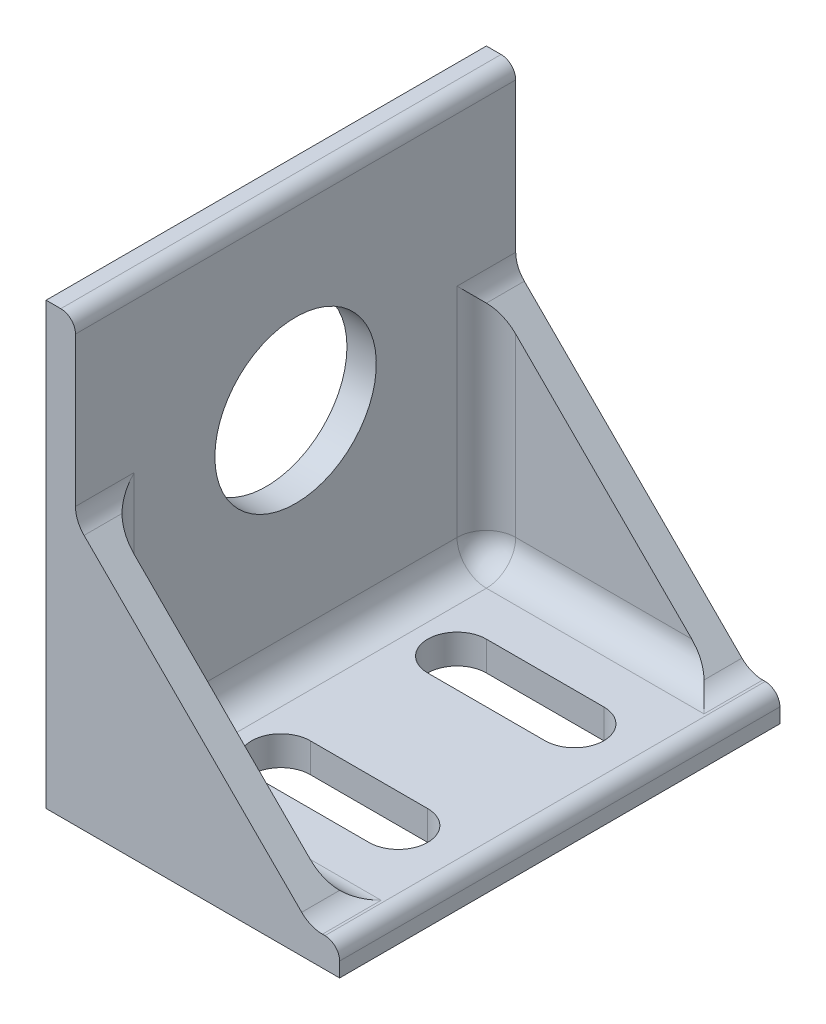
ISO-10303-21;
HEADER;
FILE_DESCRIPTION(('STEP AP214'),'2;1');
FILE_NAME('part.step','',(''),(''),'','','');
FILE_SCHEMA(('AUTOMOTIVE_DESIGN { 1 0 10303 214 1 1 1 1 }'));
ENDSEC;
DATA;
#1=APPLICATION_CONTEXT('core data for automotive mechanical design processes');
#2=APPLICATION_PROTOCOL_DEFINITION('international standard','automotive_design',2000,#1);
#3=PRODUCT_CONTEXT('',#1,'mechanical');
#4=PRODUCT('Part','Part','',(#3));
#5=PRODUCT_RELATED_PRODUCT_CATEGORY('part','',(#4));
#6=PRODUCT_DEFINITION_FORMATION('','',#4);
#7=PRODUCT_DEFINITION_CONTEXT('part definition',#1,'design');
#8=PRODUCT_DEFINITION('design','',#6,#7);
#9=PRODUCT_DEFINITION_SHAPE('','',#8);
#10=(LENGTH_UNIT() NAMED_UNIT(*) SI_UNIT(.MILLI.,.METRE.));
#11=(NAMED_UNIT(*) PLANE_ANGLE_UNIT() SI_UNIT($,.RADIAN.));
#12=(NAMED_UNIT(*) SI_UNIT($,.STERADIAN.) SOLID_ANGLE_UNIT());
#13=UNCERTAINTY_MEASURE_WITH_UNIT(LENGTH_MEASURE(1.E-05),#10,'distance_accuracy_value','');
#14=(GEOMETRIC_REPRESENTATION_CONTEXT(3) GLOBAL_UNCERTAINTY_ASSIGNED_CONTEXT((#13)) GLOBAL_UNIT_ASSIGNED_CONTEXT((#10,
#11,#12)) REPRESENTATION_CONTEXT('',''));
#15=CARTESIAN_POINT('',(0.,0.,0.));
#16=DIRECTION('',(0.,0.,1.));
#17=DIRECTION('',(1.,0.,0.));
#18=AXIS2_PLACEMENT_3D('',#15,#16,#17);
#19=CARTESIAN_POINT('',(2.,17.9999999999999,30.));
#20=DIRECTION('',(-0.707106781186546,-0.707106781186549,0.));
#21=DIRECTION('',(0.707106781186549,-0.707106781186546,0.));
#22=AXIS2_PLACEMENT_3D('',#19,#20,#21);
#23=PLANE('',#22);
#24=DIRECTION('',(-0.707106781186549,0.707106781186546,0.));
#25=VECTOR('',#24,1.);
#26=CARTESIAN_POINT('',(2.,17.9999999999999,30.));
#27=LINE('',#26,#25);
#28=CARTESIAN_POINT('',(17.4142135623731,2.5857864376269,30.));
#29=VERTEX_POINT('',#28);
#30=CARTESIAN_POINT('',(2.58578643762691,17.414213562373,30.));
#31=VERTEX_POINT('',#30);
#32=EDGE_CURVE('E308',#29,#31,#27,.T.);
#33=ORIENTED_EDGE('',*,*,#32,.F.);
#34=DIRECTION('',(0.,0.,-1.));
#35=VECTOR('',#34,1.);
#36=CARTESIAN_POINT('',(17.4142135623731,2.5857864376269,28.));
#37=LINE('',#36,#35);
#38=CARTESIAN_POINT('',(17.4142135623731,2.5857864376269,27.4142135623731));
#39=VERTEX_POINT('',#38);
#40=EDGE_CURVE('E343',#29,#39,#37,.T.);
#41=ORIENTED_EDGE('',*,*,#40,.T.);
#42=CARTESIAN_POINT('',(16.,4.,26.));
#43=DIRECTION('',(-0.707106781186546,-0.707106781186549,0.));
#44=DIRECTION('',(-0.707106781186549,0.707106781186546,0.));
#45=AXIS2_PLACEMENT_3D('',#42,#43,#44);
#46=ELLIPSE('',#45,2.8284271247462,2.);
#47=CARTESIAN_POINT('',(16.,4.,28.));
#48=VERTEX_POINT('',#47);
#49=EDGE_CURVE('E406',#39,#48,#46,.T.);
#50=ORIENTED_EDGE('',*,*,#49,.T.);
#51=DIRECTION('',(0.707106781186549,-0.707106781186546,0.));
#52=VECTOR('',#51,1.);
#53=CARTESIAN_POINT('',(2.,17.9999999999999,28.));
#54=LINE('',#53,#52);
#55=CARTESIAN_POINT('',(4.,15.9999999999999,28.));
#56=VERTEX_POINT('',#55);
#57=EDGE_CURVE('E292',#56,#48,#54,.T.);
#58=ORIENTED_EDGE('',*,*,#57,.F.);
#59=CARTESIAN_POINT('',(4.,15.9999999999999,26.));
#60=DIRECTION('',(-0.707106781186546,-0.707106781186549,0.));
#61=DIRECTION('',(0.707106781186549,-0.707106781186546,0.));
#62=AXIS2_PLACEMENT_3D('',#59,#60,#61);
#63=ELLIPSE('',#62,2.82842712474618,2.);
#64=CARTESIAN_POINT('',(2.58578643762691,17.414213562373,27.4142135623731));
#65=VERTEX_POINT('',#64);
#66=EDGE_CURVE('E408',#56,#65,#63,.T.);
#67=ORIENTED_EDGE('',*,*,#66,.T.);
#68=DIRECTION('',(0.,0.,-1.));
#69=VECTOR('',#68,1.);
#70=CARTESIAN_POINT('',(2.58578643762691,17.414213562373,30.));
#71=LINE('',#70,#69);
#72=EDGE_CURVE('E341',#65,#31,#71,.F.);
#73=ORIENTED_EDGE('',*,*,#72,.T.);
#74=EDGE_LOOP('',(#33,#41,#50,#58,#67,#73));
#75=FACE_BOUND('',#74,.T.);
#76=ADVANCED_FACE('F33',(#75),#23,.F.);
#77=DIRECTION('',(-0.707106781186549,0.707106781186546,0.));
#78=VECTOR('',#77,1.);
#79=CARTESIAN_POINT('',(2.,17.9999999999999,2.));
#80=LINE('',#79,#78);
#81=CARTESIAN_POINT('',(16.,4.,2.));
#82=VERTEX_POINT('',#81);
#83=CARTESIAN_POINT('',(4.,15.9999999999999,2.));
#84=VERTEX_POINT('',#83);
#85=EDGE_CURVE('E289',#82,#84,#80,.T.);
#86=ORIENTED_EDGE('',*,*,#85,.F.);
#87=CARTESIAN_POINT('',(16.,4.,4.));
#88=DIRECTION('',(-0.707106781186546,-0.707106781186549,0.));
#89=DIRECTION('',(-0.707106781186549,0.707106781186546,0.));
#90=AXIS2_PLACEMENT_3D('',#87,#88,#89);
#91=ELLIPSE('',#90,2.8284271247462,2.);
#92=CARTESIAN_POINT('',(17.4142135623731,2.5857864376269,2.58578643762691));
#93=VERTEX_POINT('',#92);
#94=EDGE_CURVE('E392',#82,#93,#91,.T.);
#95=ORIENTED_EDGE('',*,*,#94,.T.);
#96=DIRECTION('',(0.,0.,-1.));
#97=VECTOR('',#96,1.);
#98=CARTESIAN_POINT('',(17.4142135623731,2.5857864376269,0.));
#99=LINE('',#98,#97);
#100=CARTESIAN_POINT('',(17.4142135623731,2.5857864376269,0.));
#101=VERTEX_POINT('',#100);
#102=EDGE_CURVE('E352',#93,#101,#99,.T.);
#103=ORIENTED_EDGE('',*,*,#102,.T.);
#104=DIRECTION('',(-0.707106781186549,0.707106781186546,0.));
#105=VECTOR('',#104,1.);
#106=CARTESIAN_POINT('',(2.,17.9999999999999,0.));
#107=LINE('',#106,#105);
#108=CARTESIAN_POINT('',(2.58578643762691,17.414213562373,0.));
#109=VERTEX_POINT('',#108);
#110=EDGE_CURVE('E326',#101,#109,#107,.T.);
#111=ORIENTED_EDGE('',*,*,#110,.T.);
#112=DIRECTION('',(0.,0.,-1.));
#113=VECTOR('',#112,1.);
#114=CARTESIAN_POINT('',(2.58578643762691,17.414213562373,2.));
#115=LINE('',#114,#113);
#116=CARTESIAN_POINT('',(2.58578643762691,17.414213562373,2.5857864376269));
#117=VERTEX_POINT('',#116);
#118=EDGE_CURVE('E350',#109,#117,#115,.F.);
#119=ORIENTED_EDGE('',*,*,#118,.T.);
#120=CARTESIAN_POINT('',(4.,15.9999999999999,4.));
#121=DIRECTION('',(-0.707106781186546,-0.707106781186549,0.));
#122=DIRECTION('',(-0.707106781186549,0.707106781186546,0.));
#123=AXIS2_PLACEMENT_3D('',#120,#121,#122);
#124=ELLIPSE('',#123,2.82842712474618,2.);
#125=EDGE_CURVE('E401',#117,#84,#124,.T.);
#126=ORIENTED_EDGE('',*,*,#125,.T.);
#127=EDGE_LOOP('',(#86,#95,#103,#111,#119,#126));
#128=FACE_BOUND('',#127,.T.);
#129=ADVANCED_FACE('F475',(#128),#23,.F.);
#130=CARTESIAN_POINT('',(0.,0.,30.));
#131=DIRECTION('',(1.,0.,0.));
#132=DIRECTION('',(0.,0.,-1.));
#133=AXIS2_PLACEMENT_3D('',#130,#131,#132);
#134=PLANE('',#133);
#135=CARTESIAN_POINT('',(0.,17.,15.));
#136=DIRECTION('',(-1.,0.,0.));
#137=DIRECTION('',(0.,0.,1.));
#138=AXIS2_PLACEMENT_3D('',#135,#136,#137);
#139=CIRCLE('',#138,5.5);
#140=CARTESIAN_POINT('',(0.,17.,20.5));
#141=VERTEX_POINT('',#140);
#142=EDGE_CURVE('E280',#141,#141,#139,.T.);
#143=ORIENTED_EDGE('',*,*,#142,.F.);
#144=EDGE_LOOP('',(#143));
#145=FACE_BOUND('',#144,.T.);
#146=DIRECTION('',(0.,-1.,0.));
#147=VECTOR('',#146,1.);
#148=CARTESIAN_POINT('',(0.,0.,0.));
#149=LINE('',#148,#147);
#150=CARTESIAN_POINT('',(0.,30.,0.));
#151=VERTEX_POINT('',#150);
#152=CARTESIAN_POINT('',(0.,0.,0.));
#153=VERTEX_POINT('',#152);
#154=EDGE_CURVE('E296',#151,#153,#149,.T.);
#155=ORIENTED_EDGE('',*,*,#154,.T.);
#156=DIRECTION('',(0.,0.,-1.));
#157=VECTOR('',#156,1.);
#158=CARTESIAN_POINT('',(0.,0.,30.));
#159=LINE('',#158,#157);
#160=CARTESIAN_POINT('',(0.,0.,30.));
#161=VERTEX_POINT('',#160);
#162=EDGE_CURVE('E338',#161,#153,#159,.T.);
#163=ORIENTED_EDGE('',*,*,#162,.F.);
#164=DIRECTION('',(0.,-1.,0.));
#165=VECTOR('',#164,1.);
#166=CARTESIAN_POINT('',(0.,0.,30.));
#167=LINE('',#166,#165);
#168=CARTESIAN_POINT('',(0.,30.,30.));
#169=VERTEX_POINT('',#168);
#170=EDGE_CURVE('E297',#169,#161,#167,.T.);
#171=ORIENTED_EDGE('',*,*,#170,.F.);
#172=DIRECTION('',(0.,0.,-1.));
#173=VECTOR('',#172,1.);
#174=CARTESIAN_POINT('',(0.,30.,30.));
#175=LINE('',#174,#173);
#176=EDGE_CURVE('E316',#169,#151,#175,.T.);
#177=ORIENTED_EDGE('',*,*,#176,.T.);
#178=EDGE_LOOP('',(#155,#163,#171,#177));
#179=FACE_BOUND('',#178,.T.);
#180=ADVANCED_FACE('F460',(#145,#179),#134,.F.);
#181=CARTESIAN_POINT('',(0.,0.,30.));
#182=DIRECTION('',(0.,1.,0.));
#183=DIRECTION('',(0.,0.,1.));
#184=AXIS2_PLACEMENT_3D('',#181,#182,#183);
#185=PLANE('',#184);
#186=DIRECTION('',(-1.,0.,0.));
#187=VECTOR('',#186,1.);
#188=CARTESIAN_POINT('',(7.,0.,7.));
#189=LINE('',#188,#187);
#190=CARTESIAN_POINT('',(15.,0.,7.));
#191=VERTEX_POINT('',#190);
#192=CARTESIAN_POINT('',(7.,0.,7.));
#193=VERTEX_POINT('',#192);
#194=EDGE_CURVE('E226',#191,#193,#189,.T.);
#195=ORIENTED_EDGE('',*,*,#194,.T.);
#196=CARTESIAN_POINT('',(7.,0.,9.));
#197=DIRECTION('',(0.,1.,0.));
#198=DIRECTION('',(0.,0.,-1.));
#199=AXIS2_PLACEMENT_3D('',#196,#197,#198);
#200=CIRCLE('',#199,2.);
#201=CARTESIAN_POINT('',(7.,0.,11.));
#202=VERTEX_POINT('',#201);
#203=EDGE_CURVE('E220',#193,#202,#200,.T.);
#204=ORIENTED_EDGE('',*,*,#203,.T.);
#205=DIRECTION('',(1.,0.,0.));
#206=VECTOR('',#205,1.);
#207=CARTESIAN_POINT('',(7.,0.,11.));
#208=LINE('',#207,#206);
#209=CARTESIAN_POINT('',(15.,0.,11.));
#210=VERTEX_POINT('',#209);
#211=EDGE_CURVE('E229',#202,#210,#208,.T.);
#212=ORIENTED_EDGE('',*,*,#211,.T.);
#213=CARTESIAN_POINT('',(15.,0.,9.));
#214=DIRECTION('',(0.,1.,0.));
#215=DIRECTION('',(0.,0.,1.));
#216=AXIS2_PLACEMENT_3D('',#213,#214,#215);
#217=CIRCLE('',#216,2.);
#218=EDGE_CURVE('E49',#210,#191,#217,.T.);
#219=ORIENTED_EDGE('',*,*,#218,.T.);
#220=EDGE_LOOP('',(#195,#204,#212,#219));
#221=FACE_BOUND('',#220,.T.);
#222=DIRECTION('',(1.,0.,0.));
#223=VECTOR('',#222,1.);
#224=CARTESIAN_POINT('',(7.,0.,23.));
#225=LINE('',#224,#223);
#226=CARTESIAN_POINT('',(7.,0.,23.));
#227=VERTEX_POINT('',#226);
#228=CARTESIAN_POINT('',(15.,0.,23.));
#229=VERTEX_POINT('',#228);
#230=EDGE_CURVE('E265',#227,#229,#225,.T.);
#231=ORIENTED_EDGE('',*,*,#230,.T.);
#232=CARTESIAN_POINT('',(15.,0.,21.));
#233=DIRECTION('',(0.,1.,0.));
#234=DIRECTION('',(0.,0.,1.));
#235=AXIS2_PLACEMENT_3D('',#232,#233,#234);
#236=CIRCLE('',#235,2.);
#237=CARTESIAN_POINT('',(15.,0.,19.));
#238=VERTEX_POINT('',#237);
#239=EDGE_CURVE('E255',#229,#238,#236,.T.);
#240=ORIENTED_EDGE('',*,*,#239,.T.);
#241=DIRECTION('',(-1.,0.,0.));
#242=VECTOR('',#241,1.);
#243=CARTESIAN_POINT('',(7.,0.,19.));
#244=LINE('',#243,#242);
#245=CARTESIAN_POINT('',(7.,0.,19.));
#246=VERTEX_POINT('',#245);
#247=EDGE_CURVE('E258',#238,#246,#244,.T.);
#248=ORIENTED_EDGE('',*,*,#247,.T.);
#249=CARTESIAN_POINT('',(7.,0.,21.));
#250=DIRECTION('',(0.,1.,0.));
#251=DIRECTION('',(0.,0.,-1.));
#252=AXIS2_PLACEMENT_3D('',#249,#250,#251);
#253=CIRCLE('',#252,2.);
#254=EDGE_CURVE('E262',#246,#227,#253,.T.);
#255=ORIENTED_EDGE('',*,*,#254,.T.);
#256=EDGE_LOOP('',(#231,#240,#248,#255));
#257=FACE_BOUND('',#256,.T.);
#258=DIRECTION('',(1.,0.,0.));
#259=VECTOR('',#258,1.);
#260=CARTESIAN_POINT('',(0.,0.,0.));
#261=LINE('',#260,#259);
#262=CARTESIAN_POINT('',(20.,0.,0.));
#263=VERTEX_POINT('',#262);
#264=EDGE_CURVE('E319',#153,#263,#261,.T.);
#265=ORIENTED_EDGE('',*,*,#264,.T.);
#266=DIRECTION('',(0.,0.,-1.));
#267=VECTOR('',#266,1.);
#268=CARTESIAN_POINT('',(20.,0.,30.));
#269=LINE('',#268,#267);
#270=CARTESIAN_POINT('',(20.,0.,30.));
#271=VERTEX_POINT('',#270);
#272=EDGE_CURVE('E335',#271,#263,#269,.T.);
#273=ORIENTED_EDGE('',*,*,#272,.F.);
#274=DIRECTION('',(1.,0.,0.));
#275=VECTOR('',#274,1.);
#276=CARTESIAN_POINT('',(0.,0.,30.));
#277=LINE('',#276,#275);
#278=EDGE_CURVE('E300',#161,#271,#277,.T.);
#279=ORIENTED_EDGE('',*,*,#278,.F.);
#280=ORIENTED_EDGE('',*,*,#162,.T.);
#281=EDGE_LOOP('',(#265,#273,#279,#280));
#282=FACE_BOUND('',#281,.T.);
#283=ADVANCED_FACE('F233',(#221,#257,#282),#185,.F.);
#284=CARTESIAN_POINT('',(20.,2.,30.));
#285=DIRECTION('',(-1.,0.,0.));
#286=DIRECTION('',(0.,0.,1.));
#287=AXIS2_PLACEMENT_3D('',#284,#285,#286);
#288=PLANE('',#287);
#289=DIRECTION('',(0.,1.,0.));
#290=VECTOR('',#289,1.);
#291=CARTESIAN_POINT('',(20.,2.,0.));
#292=LINE('',#291,#290);
#293=CARTESIAN_POINT('',(20.,1.,0.));
#294=VERTEX_POINT('',#293);
#295=EDGE_CURVE('E321',#263,#294,#292,.T.);
#296=ORIENTED_EDGE('',*,*,#295,.T.);
#297=DIRECTION('',(0.,0.,-1.));
#298=VECTOR('',#297,1.);
#299=CARTESIAN_POINT('',(20.,1.,30.));
#300=LINE('',#299,#298);
#301=CARTESIAN_POINT('',(20.,1.,30.));
#302=VERTEX_POINT('',#301);
#303=EDGE_CURVE('E437',#294,#302,#300,.F.);
#304=ORIENTED_EDGE('',*,*,#303,.T.);
#305=DIRECTION('',(0.,1.,0.));
#306=VECTOR('',#305,1.);
#307=CARTESIAN_POINT('',(20.,2.,30.));
#308=LINE('',#307,#306);
#309=EDGE_CURVE('E303',#271,#302,#308,.T.);
#310=ORIENTED_EDGE('',*,*,#309,.F.);
#311=ORIENTED_EDGE('',*,*,#272,.T.);
#312=EDGE_LOOP('',(#296,#304,#310,#311));
#313=FACE_BOUND('',#312,.T.);
#314=ADVANCED_FACE('F515',(#313),#288,.F.);
#315=CARTESIAN_POINT('',(18.,2.,30.));
#316=DIRECTION('',(0.,-1.,0.));
#317=DIRECTION('',(0.,0.,-1.));
#318=AXIS2_PLACEMENT_3D('',#315,#316,#317);
#319=PLANE('',#318);
#320=DIRECTION('',(1.,0.,0.));
#321=VECTOR('',#320,1.);
#322=CARTESIAN_POINT('',(7.,2.,11.));
#323=LINE('',#322,#321);
#324=CARTESIAN_POINT('',(7.,2.,11.));
#325=VERTEX_POINT('',#324);
#326=CARTESIAN_POINT('',(15.,2.,11.));
#327=VERTEX_POINT('',#326);
#328=EDGE_CURVE('E245',#325,#327,#323,.T.);
#329=ORIENTED_EDGE('',*,*,#328,.F.);
#330=CARTESIAN_POINT('',(7.,2.,9.));
#331=DIRECTION('',(0.,1.,0.));
#332=DIRECTION('',(0.,0.,-1.));
#333=AXIS2_PLACEMENT_3D('',#330,#331,#332);
#334=CIRCLE('',#333,2.);
#335=CARTESIAN_POINT('',(7.,2.,7.));
#336=VERTEX_POINT('',#335);
#337=EDGE_CURVE('E57',#336,#325,#334,.T.);
#338=ORIENTED_EDGE('',*,*,#337,.F.);
#339=DIRECTION('',(-1.,0.,0.));
#340=VECTOR('',#339,1.);
#341=CARTESIAN_POINT('',(7.,2.,7.));
#342=LINE('',#341,#340);
#343=CARTESIAN_POINT('',(15.,2.,7.));
#344=VERTEX_POINT('',#343);
#345=EDGE_CURVE('E236',#344,#336,#342,.T.);
#346=ORIENTED_EDGE('',*,*,#345,.F.);
#347=CARTESIAN_POINT('',(15.,2.,9.));
#348=DIRECTION('',(0.,1.,0.));
#349=DIRECTION('',(0.,0.,1.));
#350=AXIS2_PLACEMENT_3D('',#347,#348,#349);
#351=CIRCLE('',#350,2.);
#352=EDGE_CURVE('E239',#327,#344,#351,.T.);
#353=ORIENTED_EDGE('',*,*,#352,.F.);
#354=EDGE_LOOP('',(#329,#338,#346,#353));
#355=FACE_BOUND('',#354,.T.);
#356=DIRECTION('',(-1.,0.,0.));
#357=VECTOR('',#356,1.);
#358=CARTESIAN_POINT('',(7.,2.,19.));
#359=LINE('',#358,#357);
#360=CARTESIAN_POINT('',(15.,2.,19.));
#361=VERTEX_POINT('',#360);
#362=CARTESIAN_POINT('',(7.,2.,19.));
#363=VERTEX_POINT('',#362);
#364=EDGE_CURVE('E270',#361,#363,#359,.T.);
#365=ORIENTED_EDGE('',*,*,#364,.F.);
#366=CARTESIAN_POINT('',(15.,2.,21.));
#367=DIRECTION('',(0.,1.,0.));
#368=DIRECTION('',(0.,0.,1.));
#369=AXIS2_PLACEMENT_3D('',#366,#367,#368);
#370=CIRCLE('',#369,2.);
#371=CARTESIAN_POINT('',(15.,2.,23.));
#372=VERTEX_POINT('',#371);
#373=EDGE_CURVE('E251',#372,#361,#370,.T.);
#374=ORIENTED_EDGE('',*,*,#373,.F.);
#375=DIRECTION('',(1.,0.,0.));
#376=VECTOR('',#375,1.);
#377=CARTESIAN_POINT('',(7.,2.,23.));
#378=LINE('',#377,#376);
#379=CARTESIAN_POINT('',(7.,2.,23.));
#380=VERTEX_POINT('',#379);
#381=EDGE_CURVE('E259',#380,#372,#378,.T.);
#382=ORIENTED_EDGE('',*,*,#381,.F.);
#383=CARTESIAN_POINT('',(7.,2.,21.));
#384=DIRECTION('',(0.,1.,0.));
#385=DIRECTION('',(0.,0.,-1.));
#386=AXIS2_PLACEMENT_3D('',#383,#384,#385);
#387=CIRCLE('',#386,2.);
#388=EDGE_CURVE('E273',#363,#380,#387,.T.);
#389=ORIENTED_EDGE('',*,*,#388,.F.);
#390=EDGE_LOOP('',(#365,#374,#382,#389));
#391=FACE_BOUND('',#390,.T.);
#392=DIRECTION('',(-1.,0.,0.));
#393=VECTOR('',#392,1.);
#394=CARTESIAN_POINT('',(18.,2.,30.));
#395=LINE('',#394,#393);
#396=CARTESIAN_POINT('',(19.,2.,30.));
#397=VERTEX_POINT('',#396);
#398=CARTESIAN_POINT('',(18.8284271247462,2.,30.));
#399=VERTEX_POINT('',#398);
#400=EDGE_CURVE('E306',#397,#399,#395,.T.);
#401=ORIENTED_EDGE('',*,*,#400,.F.);
#402=DIRECTION('',(0.,0.,-1.));
#403=VECTOR('',#402,1.);
#404=CARTESIAN_POINT('',(19.,2.,30.));
#405=LINE('',#404,#403);
#406=CARTESIAN_POINT('',(19.,2.,0.));
#407=VERTEX_POINT('',#406);
#408=EDGE_CURVE('E414',#397,#407,#405,.T.);
#409=ORIENTED_EDGE('',*,*,#408,.T.);
#410=DIRECTION('',(-1.,0.,0.));
#411=VECTOR('',#410,1.);
#412=CARTESIAN_POINT('',(18.,2.,0.));
#413=LINE('',#412,#411);
#414=CARTESIAN_POINT('',(18.8284271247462,2.,0.));
#415=VERTEX_POINT('',#414);
#416=EDGE_CURVE('E324',#407,#415,#413,.T.);
#417=ORIENTED_EDGE('',*,*,#416,.T.);
#418=DIRECTION('',(0.,0.,-1.));
#419=VECTOR('',#418,1.);
#420=CARTESIAN_POINT('',(18.8284271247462,2.,2.));
#421=LINE('',#420,#419);
#422=CARTESIAN_POINT('',(18.8284271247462,2.,4.));
#423=VERTEX_POINT('',#422);
#424=EDGE_CURVE('E345',#415,#423,#421,.F.);
#425=ORIENTED_EDGE('',*,*,#424,.T.);
#426=DIRECTION('',(-1.,0.,0.));
#427=VECTOR('',#426,1.);
#428=CARTESIAN_POINT('',(18.,2.,4.));
#429=LINE('',#428,#427);
#430=CARTESIAN_POINT('',(4.,2.,4.));
#431=VERTEX_POINT('',#430);
#432=EDGE_CURVE('E374',#423,#431,#429,.T.);
#433=ORIENTED_EDGE('',*,*,#432,.T.);
#434=DIRECTION('',(0.,0.,-1.));
#435=VECTOR('',#434,1.);
#436=CARTESIAN_POINT('',(4.,2.,28.));
#437=LINE('',#436,#435);
#438=CARTESIAN_POINT('',(4.,2.,26.));
#439=VERTEX_POINT('',#438);
#440=EDGE_CURVE('E372',#431,#439,#437,.F.);
#441=ORIENTED_EDGE('',*,*,#440,.T.);
#442=DIRECTION('',(-1.,0.,0.));
#443=VECTOR('',#442,1.);
#444=CARTESIAN_POINT('',(18.,2.,26.));
#445=LINE('',#444,#443);
#446=CARTESIAN_POINT('',(18.8284271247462,2.,26.));
#447=VERTEX_POINT('',#446);
#448=EDGE_CURVE('E369',#439,#447,#445,.F.);
#449=ORIENTED_EDGE('',*,*,#448,.T.);
#450=DIRECTION('',(0.,0.,-1.));
#451=VECTOR('',#450,1.);
#452=CARTESIAN_POINT('',(18.8284271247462,2.,30.));
#453=LINE('',#452,#451);
#454=EDGE_CURVE('E347',#447,#399,#453,.F.);
#455=ORIENTED_EDGE('',*,*,#454,.T.);
#456=EDGE_LOOP('',(#401,#409,#417,#425,#433,#441,#449,#455));
#457=FACE_BOUND('',#456,.T.);
#458=ADVANCED_FACE('F504',(#355,#391,#457),#319,.F.);
#459=CARTESIAN_POINT('',(2.,30.,30.));
#460=DIRECTION('',(-1.,0.,0.));
#461=DIRECTION('',(0.,-1.,0.));
#462=AXIS2_PLACEMENT_3D('',#459,#460,#461);
#463=PLANE('',#462);
#464=CARTESIAN_POINT('',(2.,17.,15.));
#465=DIRECTION('',(-1.,0.,0.));
#466=DIRECTION('',(0.,-1.,0.));
#467=AXIS2_PLACEMENT_3D('',#464,#465,#466);
#468=CIRCLE('',#467,5.5);
#469=CARTESIAN_POINT('',(2.,11.5,15.));
#470=VERTEX_POINT('',#469);
#471=EDGE_CURVE('E37',#470,#470,#468,.T.);
#472=ORIENTED_EDGE('',*,*,#471,.T.);
#473=EDGE_LOOP('',(#472));
#474=FACE_BOUND('',#473,.T.);
#475=DIRECTION('',(0.,1.,0.));
#476=VECTOR('',#475,1.);
#477=CARTESIAN_POINT('',(2.,30.,0.));
#478=LINE('',#477,#476);
#479=CARTESIAN_POINT('',(2.,18.8284271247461,0.));
#480=VERTEX_POINT('',#479);
#481=CARTESIAN_POINT('',(2.,29.,0.));
#482=VERTEX_POINT('',#481);
#483=EDGE_CURVE('E329',#480,#482,#478,.T.);
#484=ORIENTED_EDGE('',*,*,#483,.T.);
#485=DIRECTION('',(0.,0.,-1.));
#486=VECTOR('',#485,1.);
#487=CARTESIAN_POINT('',(2.,29.,30.));
#488=LINE('',#487,#486);
#489=CARTESIAN_POINT('',(2.,29.,30.));
#490=VERTEX_POINT('',#489);
#491=EDGE_CURVE('E11',#482,#490,#488,.F.);
#492=ORIENTED_EDGE('',*,*,#491,.T.);
#493=DIRECTION('',(0.,1.,0.));
#494=VECTOR('',#493,1.);
#495=CARTESIAN_POINT('',(2.,30.,30.));
#496=LINE('',#495,#494);
#497=CARTESIAN_POINT('',(2.,18.8284271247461,30.));
#498=VERTEX_POINT('',#497);
#499=EDGE_CURVE('E311',#498,#490,#496,.T.);
#500=ORIENTED_EDGE('',*,*,#499,.F.);
#501=DIRECTION('',(0.,0.,-1.));
#502=VECTOR('',#501,1.);
#503=CARTESIAN_POINT('',(2.,18.8284271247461,28.));
#504=LINE('',#503,#502);
#505=CARTESIAN_POINT('',(2.,18.8284271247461,26.));
#506=VERTEX_POINT('',#505);
#507=EDGE_CURVE('E355',#498,#506,#504,.T.);
#508=ORIENTED_EDGE('',*,*,#507,.T.);
#509=DIRECTION('',(0.,-1.,0.));
#510=VECTOR('',#509,1.);
#511=CARTESIAN_POINT('',(2.,30.,26.));
#512=LINE('',#511,#510);
#513=CARTESIAN_POINT('',(2.,4.,26.));
#514=VERTEX_POINT('',#513);
#515=EDGE_CURVE('E381',#506,#514,#512,.T.);
#516=ORIENTED_EDGE('',*,*,#515,.T.);
#517=DIRECTION('',(0.,0.,-1.));
#518=VECTOR('',#517,1.);
#519=CARTESIAN_POINT('',(2.,4.,2.));
#520=LINE('',#519,#518);
#521=CARTESIAN_POINT('',(2.,4.,4.));
#522=VERTEX_POINT('',#521);
#523=EDGE_CURVE('E383',#514,#522,#520,.T.);
#524=ORIENTED_EDGE('',*,*,#523,.T.);
#525=DIRECTION('',(0.,1.,0.));
#526=VECTOR('',#525,1.);
#527=CARTESIAN_POINT('',(2.,30.,4.00000000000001));
#528=LINE('',#527,#526);
#529=CARTESIAN_POINT('',(2.,18.8284271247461,4.));
#530=VERTEX_POINT('',#529);
#531=EDGE_CURVE('E385',#522,#530,#528,.T.);
#532=ORIENTED_EDGE('',*,*,#531,.T.);
#533=DIRECTION('',(0.,0.,-1.));
#534=VECTOR('',#533,1.);
#535=CARTESIAN_POINT('',(2.,18.8284271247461,0.));
#536=LINE('',#535,#534);
#537=EDGE_CURVE('E357',#530,#480,#536,.T.);
#538=ORIENTED_EDGE('',*,*,#537,.T.);
#539=EDGE_LOOP('',(#484,#492,#500,#508,#516,#524,#532,#538));
#540=FACE_BOUND('',#539,.T.);
#541=ADVANCED_FACE('F468',(#474,#540),#463,.F.);
#542=CARTESIAN_POINT('',(0.,30.,30.));
#543=DIRECTION('',(0.,-1.,0.));
#544=DIRECTION('',(0.,0.,-1.));
#545=AXIS2_PLACEMENT_3D('',#542,#543,#544);
#546=PLANE('',#545);
#547=DIRECTION('',(-1.,0.,0.));
#548=VECTOR('',#547,1.);
#549=CARTESIAN_POINT('',(0.,30.,30.));
#550=LINE('',#549,#548);
#551=CARTESIAN_POINT('',(1.,30.,30.));
#552=VERTEX_POINT('',#551);
#553=EDGE_CURVE('E314',#552,#169,#550,.T.);
#554=ORIENTED_EDGE('',*,*,#553,.F.);
#555=DIRECTION('',(0.,0.,-1.));
#556=VECTOR('',#555,1.);
#557=CARTESIAN_POINT('',(1.,30.,30.));
#558=LINE('',#557,#556);
#559=CARTESIAN_POINT('',(1.,30.,0.));
#560=VERTEX_POINT('',#559);
#561=EDGE_CURVE('E42',#552,#560,#558,.T.);
#562=ORIENTED_EDGE('',*,*,#561,.T.);
#563=DIRECTION('',(-1.,0.,0.));
#564=VECTOR('',#563,1.);
#565=CARTESIAN_POINT('',(0.,30.,0.));
#566=LINE('',#565,#564);
#567=EDGE_CURVE('E301',#560,#151,#566,.T.);
#568=ORIENTED_EDGE('',*,*,#567,.T.);
#569=ORIENTED_EDGE('',*,*,#176,.F.);
#570=EDGE_LOOP('',(#554,#562,#568,#569));
#571=FACE_BOUND('',#570,.T.);
#572=ADVANCED_FACE('F448',(#571),#546,.F.);
#573=CARTESIAN_POINT('',(0.,0.,30.));
#574=DIRECTION('',(0.,0.,-1.));
#575=DIRECTION('',(-1.,0.,0.));
#576=AXIS2_PLACEMENT_3D('',#573,#574,#575);
#577=PLANE('',#576);
#578=ORIENTED_EDGE('',*,*,#309,.T.);
#579=CARTESIAN_POINT('',(19.,1.,30.));
#580=DIRECTION('',(0.,0.,-1.));
#581=DIRECTION('',(-1.,0.,0.));
#582=AXIS2_PLACEMENT_3D('',#579,#580,#581);
#583=CIRCLE('',#582,1.);
#584=EDGE_CURVE('E441',#302,#397,#583,.F.);
#585=ORIENTED_EDGE('',*,*,#584,.T.);
#586=ORIENTED_EDGE('',*,*,#400,.T.);
#587=CARTESIAN_POINT('',(18.8284271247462,4.,30.));
#588=DIRECTION('',(0.,0.,-1.));
#589=DIRECTION('',(-1.,0.,0.));
#590=AXIS2_PLACEMENT_3D('',#587,#588,#589);
#591=CIRCLE('',#590,2.);
#592=EDGE_CURVE('E360',#399,#29,#591,.T.);
#593=ORIENTED_EDGE('',*,*,#592,.T.);
#594=ORIENTED_EDGE('',*,*,#32,.T.);
#595=CARTESIAN_POINT('',(4.,18.8284271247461,30.));
#596=DIRECTION('',(0.,0.,-1.));
#597=DIRECTION('',(-1.,0.,0.));
#598=AXIS2_PLACEMENT_3D('',#595,#596,#597);
#599=CIRCLE('',#598,2.);
#600=EDGE_CURVE('E367',#31,#498,#599,.T.);
#601=ORIENTED_EDGE('',*,*,#600,.T.);
#602=ORIENTED_EDGE('',*,*,#499,.T.);
#603=CARTESIAN_POINT('',(1.,29.,30.));
#604=DIRECTION('',(0.,0.,-1.));
#605=DIRECTION('',(-1.,0.,0.));
#606=AXIS2_PLACEMENT_3D('',#603,#604,#605);
#607=CIRCLE('',#606,1.);
#608=EDGE_CURVE('E439',#490,#552,#607,.F.);
#609=ORIENTED_EDGE('',*,*,#608,.T.);
#610=ORIENTED_EDGE('',*,*,#553,.T.);
#611=ORIENTED_EDGE('',*,*,#170,.T.);
#612=ORIENTED_EDGE('',*,*,#278,.T.);
#613=EDGE_LOOP('',(#578,#585,#586,#593,#594,#601,#602,#609,#610,#611,#612));
#614=FACE_BOUND('',#613,.T.);
#615=ADVANCED_FACE('F463',(#614),#577,.F.);
#616=CARTESIAN_POINT('',(0.,0.,0.));
#617=DIRECTION('',(0.,0.,-1.));
#618=DIRECTION('',(-1.,0.,0.));
#619=AXIS2_PLACEMENT_3D('',#616,#617,#618);
#620=PLANE('',#619);
#621=ORIENTED_EDGE('',*,*,#416,.F.);
#622=CARTESIAN_POINT('',(19.,1.,0.));
#623=DIRECTION('',(0.,0.,-1.));
#624=DIRECTION('',(-1.,0.,0.));
#625=AXIS2_PLACEMENT_3D('',#622,#623,#624);
#626=CIRCLE('',#625,1.);
#627=EDGE_CURVE('E435',#407,#294,#626,.T.);
#628=ORIENTED_EDGE('',*,*,#627,.T.);
#629=ORIENTED_EDGE('',*,*,#295,.F.);
#630=ORIENTED_EDGE('',*,*,#264,.F.);
#631=ORIENTED_EDGE('',*,*,#154,.F.);
#632=ORIENTED_EDGE('',*,*,#567,.F.);
#633=CARTESIAN_POINT('',(1.,29.,0.));
#634=DIRECTION('',(0.,0.,-1.));
#635=DIRECTION('',(-1.,0.,0.));
#636=AXIS2_PLACEMENT_3D('',#633,#634,#635);
#637=CIRCLE('',#636,1.);
#638=EDGE_CURVE('E433',#560,#482,#637,.T.);
#639=ORIENTED_EDGE('',*,*,#638,.T.);
#640=ORIENTED_EDGE('',*,*,#483,.F.);
#641=CARTESIAN_POINT('',(4.,18.8284271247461,0.));
#642=DIRECTION('',(0.,0.,-1.));
#643=DIRECTION('',(-1.,0.,0.));
#644=AXIS2_PLACEMENT_3D('',#641,#642,#643);
#645=CIRCLE('',#644,2.);
#646=EDGE_CURVE('E365',#480,#109,#645,.F.);
#647=ORIENTED_EDGE('',*,*,#646,.T.);
#648=ORIENTED_EDGE('',*,*,#110,.F.);
#649=CARTESIAN_POINT('',(18.8284271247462,4.,0.));
#650=DIRECTION('',(0.,0.,-1.));
#651=DIRECTION('',(-1.,0.,0.));
#652=AXIS2_PLACEMENT_3D('',#649,#650,#651);
#653=CIRCLE('',#652,2.);
#654=EDGE_CURVE('E362',#101,#415,#653,.F.);
#655=ORIENTED_EDGE('',*,*,#654,.T.);
#656=EDGE_LOOP('',(#621,#628,#629,#630,#631,#632,#639,#640,#647,#648,#655));
#657=FACE_BOUND('',#656,.T.);
#658=ADVANCED_FACE('F455',(#657),#620,.T.);
#659=CARTESIAN_POINT('',(32.,23.,28.));
#660=DIRECTION('',(0.,0.,-1.));
#661=DIRECTION('',(0.,1.,0.));
#662=AXIS2_PLACEMENT_3D('',#659,#660,#661);
#663=PLANE('',#662);
#664=ORIENTED_EDGE('',*,*,#57,.T.);
#665=DIRECTION('',(-1.,0.,0.));
#666=VECTOR('',#665,1.);
#667=CARTESIAN_POINT('',(32.,4.,28.));
#668=LINE('',#667,#666);
#669=CARTESIAN_POINT('',(4.,4.,28.));
#670=VERTEX_POINT('',#669);
#671=EDGE_CURVE('E390',#48,#670,#668,.T.);
#672=ORIENTED_EDGE('',*,*,#671,.T.);
#673=DIRECTION('',(0.,-1.,0.));
#674=VECTOR('',#673,1.);
#675=CARTESIAN_POINT('',(4.,23.,28.));
#676=LINE('',#675,#674);
#677=EDGE_CURVE('E388',#670,#56,#676,.F.);
#678=ORIENTED_EDGE('',*,*,#677,.T.);
#679=EDGE_LOOP('',(#664,#672,#678));
#680=FACE_BOUND('',#679,.T.);
#681=ADVANCED_FACE('F542',(#680),#663,.T.);
#682=CARTESIAN_POINT('',(32.,23.,2.));
#683=DIRECTION('',(0.,0.,1.));
#684=DIRECTION('',(0.,-1.,0.));
#685=AXIS2_PLACEMENT_3D('',#682,#683,#684);
#686=PLANE('',#685);
#687=DIRECTION('',(0.,1.,0.));
#688=VECTOR('',#687,1.);
#689=CARTESIAN_POINT('',(4.,23.,2.));
#690=LINE('',#689,#688);
#691=CARTESIAN_POINT('',(4.,4.,2.));
#692=VERTEX_POINT('',#691);
#693=EDGE_CURVE('E377',#84,#692,#690,.F.);
#694=ORIENTED_EDGE('',*,*,#693,.T.);
#695=DIRECTION('',(-1.,0.,0.));
#696=VECTOR('',#695,1.);
#697=CARTESIAN_POINT('',(32.,4.,2.));
#698=LINE('',#697,#696);
#699=EDGE_CURVE('E379',#692,#82,#698,.F.);
#700=ORIENTED_EDGE('',*,*,#699,.T.);
#701=ORIENTED_EDGE('',*,*,#85,.T.);
#702=EDGE_LOOP('',(#694,#700,#701));
#703=FACE_BOUND('',#702,.T.);
#704=ADVANCED_FACE('F486',(#703),#686,.T.);
#705=CARTESIAN_POINT('',(18.8284271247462,4.,30.));
#706=DIRECTION('',(0.,0.,1.));
#707=DIRECTION('',(1.,0.,0.));
#708=AXIS2_PLACEMENT_3D('',#705,#706,#707);
#709=CYLINDRICAL_SURFACE('',#708,2.);
#710=ORIENTED_EDGE('',*,*,#592,.F.);
#711=ORIENTED_EDGE('',*,*,#454,.F.);
#712=CARTESIAN_POINT('',(18.8284271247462,4.,26.));
#713=DIRECTION('',(0.707106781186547,0.,0.707106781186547));
#714=DIRECTION('',(-0.707106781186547,0.,0.707106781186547));
#715=AXIS2_PLACEMENT_3D('',#712,#713,#714);
#716=ELLIPSE('',#715,2.82842712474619,2.);
#717=EDGE_CURVE('E403',#447,#39,#716,.F.);
#718=ORIENTED_EDGE('',*,*,#717,.T.);
#719=ORIENTED_EDGE('',*,*,#40,.F.);
#720=EDGE_LOOP('',(#710,#711,#718,#719));
#721=FACE_BOUND('',#720,.T.);
#722=ADVANCED_FACE('F521',(#721),#709,.F.);
#723=CARTESIAN_POINT('',(18.8284271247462,4.,30.));
#724=DIRECTION('',(0.,0.,1.));
#725=DIRECTION('',(1.,0.,0.));
#726=AXIS2_PLACEMENT_3D('',#723,#724,#725);
#727=CYLINDRICAL_SURFACE('',#726,2.);
#728=ORIENTED_EDGE('',*,*,#102,.F.);
#729=CARTESIAN_POINT('',(18.8284271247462,4.,4.));
#730=DIRECTION('',(-0.707106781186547,0.,0.707106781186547));
#731=DIRECTION('',(0.707106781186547,0.,0.707106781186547));
#732=AXIS2_PLACEMENT_3D('',#729,#730,#731);
#733=ELLIPSE('',#732,2.82842712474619,2.);
#734=EDGE_CURVE('E395',#93,#423,#733,.T.);
#735=ORIENTED_EDGE('',*,*,#734,.T.);
#736=ORIENTED_EDGE('',*,*,#424,.F.);
#737=ORIENTED_EDGE('',*,*,#654,.F.);
#738=EDGE_LOOP('',(#728,#735,#736,#737));
#739=FACE_BOUND('',#738,.T.);
#740=ADVANCED_FACE('F507',(#739),#727,.F.);
#741=CARTESIAN_POINT('',(4.,18.8284271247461,30.));
#742=DIRECTION('',(0.,0.,1.));
#743=DIRECTION('',(1.,0.,0.));
#744=AXIS2_PLACEMENT_3D('',#741,#742,#743);
#745=CYLINDRICAL_SURFACE('',#744,2.);
#746=ORIENTED_EDGE('',*,*,#537,.F.);
#747=CARTESIAN_POINT('',(4.,18.8284271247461,4.));
#748=DIRECTION('',(0.,-0.707106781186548,0.707106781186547));
#749=DIRECTION('',(0.,0.707106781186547,0.707106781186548));
#750=AXIS2_PLACEMENT_3D('',#747,#748,#749);
#751=ELLIPSE('',#750,2.82842712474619,2.);
#752=EDGE_CURVE('E398',#530,#117,#751,.T.);
#753=ORIENTED_EDGE('',*,*,#752,.T.);
#754=ORIENTED_EDGE('',*,*,#118,.F.);
#755=ORIENTED_EDGE('',*,*,#646,.F.);
#756=EDGE_LOOP('',(#746,#753,#754,#755));
#757=FACE_BOUND('',#756,.T.);
#758=ADVANCED_FACE('F476',(#757),#745,.F.);
#759=CARTESIAN_POINT('',(4.,18.8284271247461,30.));
#760=DIRECTION('',(0.,0.,1.));
#761=DIRECTION('',(1.,0.,0.));
#762=AXIS2_PLACEMENT_3D('',#759,#760,#761);
#763=CYLINDRICAL_SURFACE('',#762,2.);
#764=ORIENTED_EDGE('',*,*,#600,.F.);
#765=ORIENTED_EDGE('',*,*,#72,.F.);
#766=CARTESIAN_POINT('',(4.,18.8284271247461,26.));
#767=DIRECTION('',(0.,0.707106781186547,0.707106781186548));
#768=DIRECTION('',(0.,-0.707106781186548,0.707106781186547));
#769=AXIS2_PLACEMENT_3D('',#766,#767,#768);
#770=ELLIPSE('',#769,2.82842712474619,2.);
#771=EDGE_CURVE('E411',#65,#506,#770,.F.);
#772=ORIENTED_EDGE('',*,*,#771,.T.);
#773=ORIENTED_EDGE('',*,*,#507,.F.);
#774=EDGE_LOOP('',(#764,#765,#772,#773));
#775=FACE_BOUND('',#774,.T.);
#776=ADVANCED_FACE('F527',(#775),#763,.F.);
#777=CARTESIAN_POINT('',(32.,4.,26.));
#778=DIRECTION('',(-1.,0.,0.));
#779=DIRECTION('',(0.,0.,1.));
#780=AXIS2_PLACEMENT_3D('',#777,#778,#779);
#781=CYLINDRICAL_SURFACE('',#780,2.);
#782=ORIENTED_EDGE('',*,*,#717,.F.);
#783=ORIENTED_EDGE('',*,*,#448,.F.);
#784=CARTESIAN_POINT('',(4.,4.,26.));
#785=DIRECTION('',(1.,0.,0.));
#786=DIRECTION('',(0.,0.,-1.));
#787=AXIS2_PLACEMENT_3D('',#784,#785,#786);
#788=CIRCLE('',#787,2.);
#789=EDGE_CURVE('E293',#670,#439,#788,.T.);
#790=ORIENTED_EDGE('',*,*,#789,.F.);
#791=ORIENTED_EDGE('',*,*,#671,.F.);
#792=ORIENTED_EDGE('',*,*,#49,.F.);
#793=EDGE_LOOP('',(#782,#783,#790,#791,#792));
#794=FACE_BOUND('',#793,.T.);
#795=ADVANCED_FACE('F540',(#794),#781,.F.);
#796=CARTESIAN_POINT('',(4.,30.,26.));
#797=DIRECTION('',(0.,-1.,0.));
#798=DIRECTION('',(0.,0.,-1.));
#799=AXIS2_PLACEMENT_3D('',#796,#797,#798);
#800=CYLINDRICAL_SURFACE('',#799,2.);
#801=ORIENTED_EDGE('',*,*,#66,.F.);
#802=ORIENTED_EDGE('',*,*,#677,.F.);
#803=CARTESIAN_POINT('',(4.,4.,26.));
#804=DIRECTION('',(0.,1.,0.));
#805=DIRECTION('',(0.,0.,1.));
#806=AXIS2_PLACEMENT_3D('',#803,#804,#805);
#807=CIRCLE('',#806,2.);
#808=EDGE_CURVE('E426',#514,#670,#807,.T.);
#809=ORIENTED_EDGE('',*,*,#808,.F.);
#810=ORIENTED_EDGE('',*,*,#515,.F.);
#811=ORIENTED_EDGE('',*,*,#771,.F.);
#812=EDGE_LOOP('',(#801,#802,#809,#810,#811));
#813=FACE_BOUND('',#812,.T.);
#814=ADVANCED_FACE('F534',(#813),#800,.F.);
#815=CARTESIAN_POINT('',(4.,4.,26.));
#816=DIRECTION('',(0.,0.,1.));
#817=DIRECTION('',(1.,0.,0.));
#818=AXIS2_PLACEMENT_3D('',#815,#816,#817);
#819=SPHERICAL_SURFACE('',#818,2.);
#820=ORIENTED_EDGE('',*,*,#808,.T.);
#821=ORIENTED_EDGE('',*,*,#789,.T.);
#822=CARTESIAN_POINT('',(4.,4.,26.));
#823=DIRECTION('',(0.,0.,-1.));
#824=DIRECTION('',(-1.,0.,0.));
#825=AXIS2_PLACEMENT_3D('',#822,#823,#824);
#826=CIRCLE('',#825,2.);
#827=EDGE_CURVE('E423',#514,#439,#826,.F.);
#828=ORIENTED_EDGE('',*,*,#827,.F.);
#829=EDGE_LOOP('',(#820,#821,#828));
#830=FACE_BOUND('',#829,.T.);
#831=ADVANCED_FACE('F537',(#830),#819,.F.);
#832=CARTESIAN_POINT('',(4.,4.,30.));
#833=DIRECTION('',(0.,0.,1.));
#834=DIRECTION('',(1.,0.,0.));
#835=AXIS2_PLACEMENT_3D('',#832,#833,#834);
#836=CYLINDRICAL_SURFACE('',#835,2.);
#837=ORIENTED_EDGE('',*,*,#827,.T.);
#838=ORIENTED_EDGE('',*,*,#440,.F.);
#839=CARTESIAN_POINT('',(4.,4.,4.));
#840=DIRECTION('',(0.,0.,1.));
#841=DIRECTION('',(0.,-1.,0.));
#842=AXIS2_PLACEMENT_3D('',#839,#840,#841);
#843=CIRCLE('',#842,2.);
#844=EDGE_CURVE('E420',#522,#431,#843,.T.);
#845=ORIENTED_EDGE('',*,*,#844,.F.);
#846=ORIENTED_EDGE('',*,*,#523,.F.);
#847=EDGE_LOOP('',(#837,#838,#845,#846));
#848=FACE_BOUND('',#847,.T.);
#849=ADVANCED_FACE('F499',(#848),#836,.F.);
#850=CARTESIAN_POINT('',(4.,30.,4.));
#851=DIRECTION('',(0.,1.,0.));
#852=DIRECTION('',(0.,0.,1.));
#853=AXIS2_PLACEMENT_3D('',#850,#851,#852);
#854=CYLINDRICAL_SURFACE('',#853,2.);
#855=ORIENTED_EDGE('',*,*,#752,.F.);
#856=ORIENTED_EDGE('',*,*,#531,.F.);
#857=CARTESIAN_POINT('',(4.,4.,4.));
#858=DIRECTION('',(0.,1.,0.));
#859=DIRECTION('',(0.,0.,1.));
#860=AXIS2_PLACEMENT_3D('',#857,#858,#859);
#861=CIRCLE('',#860,2.);
#862=EDGE_CURVE('E417',#692,#522,#861,.T.);
#863=ORIENTED_EDGE('',*,*,#862,.F.);
#864=ORIENTED_EDGE('',*,*,#693,.F.);
#865=ORIENTED_EDGE('',*,*,#125,.F.);
#866=EDGE_LOOP('',(#855,#856,#863,#864,#865));
#867=FACE_BOUND('',#866,.T.);
#868=ADVANCED_FACE('F482',(#867),#854,.F.);
#869=CARTESIAN_POINT('',(4.,4.,4.));
#870=DIRECTION('',(0.,0.,1.));
#871=DIRECTION('',(1.,0.,0.));
#872=AXIS2_PLACEMENT_3D('',#869,#870,#871);
#873=SPHERICAL_SURFACE('',#872,2.);
#874=ORIENTED_EDGE('',*,*,#862,.T.);
#875=ORIENTED_EDGE('',*,*,#844,.T.);
#876=CARTESIAN_POINT('',(4.,4.,4.));
#877=DIRECTION('',(1.,0.,0.));
#878=DIRECTION('',(0.,0.,-1.));
#879=AXIS2_PLACEMENT_3D('',#876,#877,#878);
#880=CIRCLE('',#879,2.);
#881=EDGE_CURVE('E415',#692,#431,#880,.F.);
#882=ORIENTED_EDGE('',*,*,#881,.F.);
#883=EDGE_LOOP('',(#874,#875,#882));
#884=FACE_BOUND('',#883,.T.);
#885=ADVANCED_FACE('F494',(#884),#873,.F.);
#886=CARTESIAN_POINT('',(18.,4.,4.));
#887=DIRECTION('',(-1.,0.,0.));
#888=DIRECTION('',(0.,0.,1.));
#889=AXIS2_PLACEMENT_3D('',#886,#887,#888);
#890=CYLINDRICAL_SURFACE('',#889,2.);
#891=ORIENTED_EDGE('',*,*,#94,.F.);
#892=ORIENTED_EDGE('',*,*,#699,.F.);
#893=ORIENTED_EDGE('',*,*,#881,.T.);
#894=ORIENTED_EDGE('',*,*,#432,.F.);
#895=ORIENTED_EDGE('',*,*,#734,.F.);
#896=EDGE_LOOP('',(#891,#892,#893,#894,#895));
#897=FACE_BOUND('',#896,.T.);
#898=ADVANCED_FACE('F490',(#897),#890,.F.);
#899=CARTESIAN_POINT('',(19.,1.,30.));
#900=DIRECTION('',(0.,0.,-1.));
#901=DIRECTION('',(-1.,0.,0.));
#902=AXIS2_PLACEMENT_3D('',#899,#900,#901);
#903=CYLINDRICAL_SURFACE('',#902,1.);
#904=ORIENTED_EDGE('',*,*,#584,.F.);
#905=ORIENTED_EDGE('',*,*,#303,.F.);
#906=ORIENTED_EDGE('',*,*,#627,.F.);
#907=ORIENTED_EDGE('',*,*,#408,.F.);
#908=EDGE_LOOP('',(#904,#905,#906,#907));
#909=FACE_BOUND('',#908,.T.);
#910=ADVANCED_FACE('F511',(#909),#903,.T.);
#911=CARTESIAN_POINT('',(1.,29.,30.));
#912=DIRECTION('',(0.,0.,-1.));
#913=DIRECTION('',(-1.,0.,0.));
#914=AXIS2_PLACEMENT_3D('',#911,#912,#913);
#915=CYLINDRICAL_SURFACE('',#914,1.);
#916=ORIENTED_EDGE('',*,*,#608,.F.);
#917=ORIENTED_EDGE('',*,*,#491,.F.);
#918=ORIENTED_EDGE('',*,*,#638,.F.);
#919=ORIENTED_EDGE('',*,*,#561,.F.);
#920=EDGE_LOOP('',(#916,#917,#918,#919));
#921=FACE_BOUND('',#920,.T.);
#922=ADVANCED_FACE('F35',(#921),#915,.T.);
#923=CARTESIAN_POINT('',(20.,17.,15.));
#924=DIRECTION('',(-1.,0.,0.));
#925=DIRECTION('',(0.,0.,1.));
#926=AXIS2_PLACEMENT_3D('',#923,#924,#925);
#927=CYLINDRICAL_SURFACE('',#926,5.5);
#928=ORIENTED_EDGE('',*,*,#142,.T.);
#929=EDGE_LOOP('',(#928));
#930=FACE_BOUND('',#929,.T.);
#931=ORIENTED_EDGE('',*,*,#471,.F.);
#932=EDGE_LOOP('',(#931));
#933=FACE_BOUND('',#932,.T.);
#934=ADVANCED_FACE('F595',(#930,#933),#927,.F.);
#935=CARTESIAN_POINT('',(15.,0.,21.));
#936=DIRECTION('',(0.,1.,0.));
#937=DIRECTION('',(0.,0.,1.));
#938=AXIS2_PLACEMENT_3D('',#935,#936,#937);
#939=CYLINDRICAL_SURFACE('',#938,2.);
#940=ORIENTED_EDGE('',*,*,#373,.T.);
#941=DIRECTION('',(0.,1.,0.));
#942=VECTOR('',#941,1.);
#943=CARTESIAN_POINT('',(15.,0.,19.));
#944=LINE('',#943,#942);
#945=EDGE_CURVE('E268',#238,#361,#944,.T.);
#946=ORIENTED_EDGE('',*,*,#945,.F.);
#947=ORIENTED_EDGE('',*,*,#239,.F.);
#948=DIRECTION('',(0.,1.,0.));
#949=VECTOR('',#948,1.);
#950=CARTESIAN_POINT('',(15.,0.,23.));
#951=LINE('',#950,#949);
#952=EDGE_CURVE('E278',#229,#372,#951,.T.);
#953=ORIENTED_EDGE('',*,*,#952,.T.);
#954=EDGE_LOOP('',(#940,#946,#947,#953));
#955=FACE_BOUND('',#954,.T.);
#956=ADVANCED_FACE('F599',(#955),#939,.F.);
#957=CARTESIAN_POINT('',(7.,0.,23.));
#958=DIRECTION('',(0.,0.,1.));
#959=DIRECTION('',(1.,0.,0.));
#960=AXIS2_PLACEMENT_3D('',#957,#958,#959);
#961=PLANE('',#960);
#962=ORIENTED_EDGE('',*,*,#381,.T.);
#963=ORIENTED_EDGE('',*,*,#952,.F.);
#964=ORIENTED_EDGE('',*,*,#230,.F.);
#965=DIRECTION('',(0.,1.,0.));
#966=VECTOR('',#965,1.);
#967=CARTESIAN_POINT('',(7.,0.,23.));
#968=LINE('',#967,#966);
#969=EDGE_CURVE('E281',#227,#380,#968,.T.);
#970=ORIENTED_EDGE('',*,*,#969,.T.);
#971=EDGE_LOOP('',(#962,#963,#964,#970));
#972=FACE_BOUND('',#971,.T.);
#973=ADVANCED_FACE('F605',(#972),#961,.F.);
#974=CARTESIAN_POINT('',(7.,0.,21.));
#975=DIRECTION('',(0.,1.,0.));
#976=DIRECTION('',(0.,0.,1.));
#977=AXIS2_PLACEMENT_3D('',#974,#975,#976);
#978=CYLINDRICAL_SURFACE('',#977,2.);
#979=ORIENTED_EDGE('',*,*,#388,.T.);
#980=ORIENTED_EDGE('',*,*,#969,.F.);
#981=ORIENTED_EDGE('',*,*,#254,.F.);
#982=DIRECTION('',(0.,1.,0.));
#983=VECTOR('',#982,1.);
#984=CARTESIAN_POINT('',(7.,0.,19.));
#985=LINE('',#984,#983);
#986=EDGE_CURVE('E283',#246,#363,#985,.T.);
#987=ORIENTED_EDGE('',*,*,#986,.T.);
#988=EDGE_LOOP('',(#979,#980,#981,#987));
#989=FACE_BOUND('',#988,.T.);
#990=ADVANCED_FACE('F613',(#989),#978,.F.);
#991=CARTESIAN_POINT('',(7.,0.,19.));
#992=DIRECTION('',(0.,0.,-1.));
#993=DIRECTION('',(-1.,0.,0.));
#994=AXIS2_PLACEMENT_3D('',#991,#992,#993);
#995=PLANE('',#994);
#996=ORIENTED_EDGE('',*,*,#364,.T.);
#997=ORIENTED_EDGE('',*,*,#986,.F.);
#998=ORIENTED_EDGE('',*,*,#247,.F.);
#999=ORIENTED_EDGE('',*,*,#945,.T.);
#1000=EDGE_LOOP('',(#996,#997,#998,#999));
#1001=FACE_BOUND('',#1000,.T.);
#1002=ADVANCED_FACE('F610',(#1001),#995,.F.);
#1003=CARTESIAN_POINT('',(7.,0.,9.));
#1004=DIRECTION('',(0.,1.,0.));
#1005=DIRECTION('',(0.,0.,1.));
#1006=AXIS2_PLACEMENT_3D('',#1003,#1004,#1005);
#1007=CYLINDRICAL_SURFACE('',#1006,2.);
#1008=ORIENTED_EDGE('',*,*,#337,.T.);
#1009=DIRECTION('',(0.,1.,0.));
#1010=VECTOR('',#1009,1.);
#1011=CARTESIAN_POINT('',(7.,0.,11.));
#1012=LINE('',#1011,#1010);
#1013=EDGE_CURVE('E216',#202,#325,#1012,.T.);
#1014=ORIENTED_EDGE('',*,*,#1013,.F.);
#1015=ORIENTED_EDGE('',*,*,#203,.F.);
#1016=DIRECTION('',(0.,1.,0.));
#1017=VECTOR('',#1016,1.);
#1018=CARTESIAN_POINT('',(7.,0.,7.));
#1019=LINE('',#1018,#1017);
#1020=EDGE_CURVE('E249',#193,#336,#1019,.T.);
#1021=ORIENTED_EDGE('',*,*,#1020,.T.);
#1022=EDGE_LOOP('',(#1008,#1014,#1015,#1021));
#1023=FACE_BOUND('',#1022,.T.);
#1024=ADVANCED_FACE('F218',(#1023),#1007,.F.);
#1025=CARTESIAN_POINT('',(7.,0.,7.));
#1026=DIRECTION('',(0.,0.,-1.));
#1027=DIRECTION('',(-1.,0.,0.));
#1028=AXIS2_PLACEMENT_3D('',#1025,#1026,#1027);
#1029=PLANE('',#1028);
#1030=ORIENTED_EDGE('',*,*,#345,.T.);
#1031=ORIENTED_EDGE('',*,*,#1020,.F.);
#1032=ORIENTED_EDGE('',*,*,#194,.F.);
#1033=DIRECTION('',(0.,1.,0.));
#1034=VECTOR('',#1033,1.);
#1035=CARTESIAN_POINT('',(15.,0.,7.));
#1036=LINE('',#1035,#1034);
#1037=EDGE_CURVE('E252',#191,#344,#1036,.T.);
#1038=ORIENTED_EDGE('',*,*,#1037,.T.);
#1039=EDGE_LOOP('',(#1030,#1031,#1032,#1038));
#1040=FACE_BOUND('',#1039,.T.);
#1041=ADVANCED_FACE('F623',(#1040),#1029,.F.);
#1042=CARTESIAN_POINT('',(15.,0.,9.));
#1043=DIRECTION('',(0.,1.,0.));
#1044=DIRECTION('',(0.,0.,1.));
#1045=AXIS2_PLACEMENT_3D('',#1042,#1043,#1044);
#1046=CYLINDRICAL_SURFACE('',#1045,2.);
#1047=ORIENTED_EDGE('',*,*,#352,.T.);
#1048=ORIENTED_EDGE('',*,*,#1037,.F.);
#1049=ORIENTED_EDGE('',*,*,#218,.F.);
#1050=DIRECTION('',(0.,1.,0.));
#1051=VECTOR('',#1050,1.);
#1052=CARTESIAN_POINT('',(15.,0.,11.));
#1053=LINE('',#1052,#1051);
#1054=EDGE_CURVE('E225',#210,#327,#1053,.T.);
#1055=ORIENTED_EDGE('',*,*,#1054,.T.);
#1056=EDGE_LOOP('',(#1047,#1048,#1049,#1055));
#1057=FACE_BOUND('',#1056,.T.);
#1058=ADVANCED_FACE('F626',(#1057),#1046,.F.);
#1059=CARTESIAN_POINT('',(7.,0.,11.));
#1060=DIRECTION('',(0.,0.,1.));
#1061=DIRECTION('',(1.,0.,0.));
#1062=AXIS2_PLACEMENT_3D('',#1059,#1060,#1061);
#1063=PLANE('',#1062);
#1064=ORIENTED_EDGE('',*,*,#328,.T.);
#1065=ORIENTED_EDGE('',*,*,#1054,.F.);
#1066=ORIENTED_EDGE('',*,*,#211,.F.);
#1067=ORIENTED_EDGE('',*,*,#1013,.T.);
#1068=EDGE_LOOP('',(#1064,#1065,#1066,#1067));
#1069=FACE_BOUND('',#1068,.T.);
#1070=ADVANCED_FACE('F230',(#1069),#1063,.F.);
#1071=CLOSED_SHELL('',(#76,#129,#180,#283,#314,#458,#541,#572,#615,#658,#681,#704,#722,#740,
#758,#776,#795,#814,#831,#849,#868,#885,#898,#910,#922,#934,#956,#973,#990,#1002,#1024,#1041,
#1058,#1070));
#1072=MANIFOLD_SOLID_BREP('B2',#1071);
#1073=ADVANCED_BREP_SHAPE_REPRESENTATION('',(#18,#1072),#14);
#1074=SHAPE_DEFINITION_REPRESENTATION(#9,#1073);
ENDSEC;
END-ISO-10303-21;
